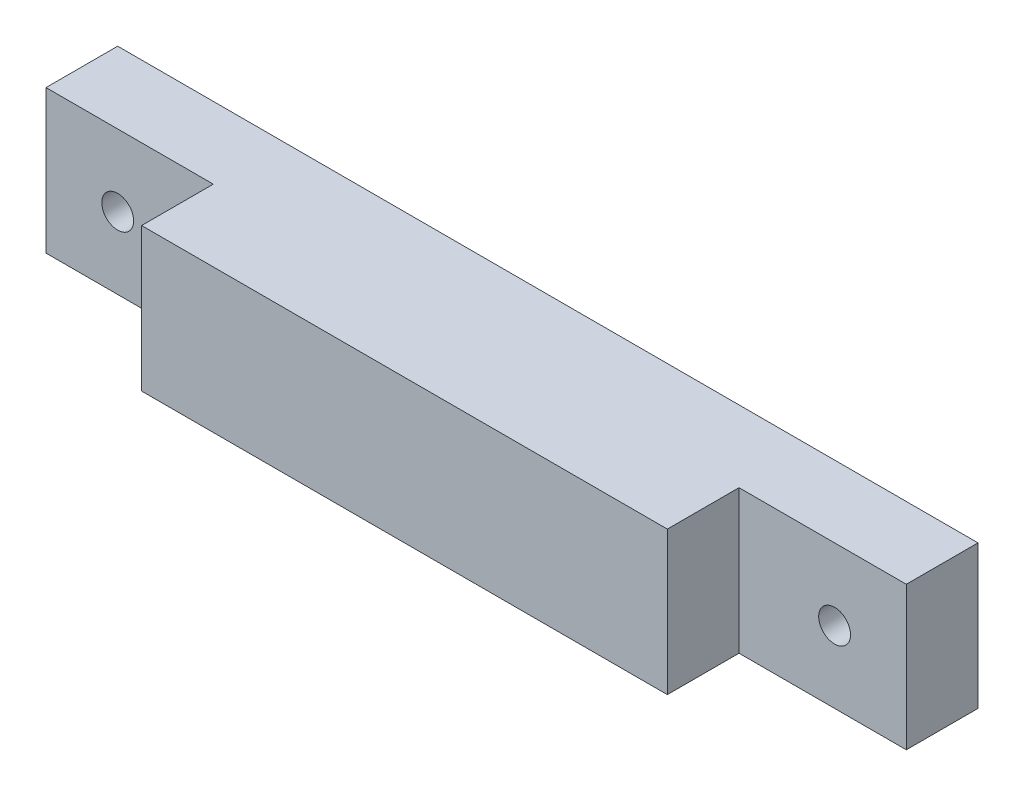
ISO-10303-21;
HEADER;
FILE_DESCRIPTION(('STEP AP214'),'2;1');
FILE_NAME('part.step','',(''),(''),'','','');
FILE_SCHEMA(('AUTOMOTIVE_DESIGN { 1 0 10303 214 1 1 1 1 }'));
ENDSEC;
DATA;
#1=APPLICATION_CONTEXT('core data for automotive mechanical design processes');
#2=APPLICATION_PROTOCOL_DEFINITION('international standard','automotive_design',2000,#1);
#3=PRODUCT_CONTEXT('',#1,'mechanical');
#4=PRODUCT('Part','Part','',(#3));
#5=PRODUCT_RELATED_PRODUCT_CATEGORY('part','',(#4));
#6=PRODUCT_DEFINITION_FORMATION('','',#4);
#7=PRODUCT_DEFINITION_CONTEXT('part definition',#1,'design');
#8=PRODUCT_DEFINITION('design','',#6,#7);
#9=PRODUCT_DEFINITION_SHAPE('','',#8);
#10=(LENGTH_UNIT() NAMED_UNIT(*) SI_UNIT(.MILLI.,.METRE.));
#11=(NAMED_UNIT(*) PLANE_ANGLE_UNIT() SI_UNIT($,.RADIAN.));
#12=(NAMED_UNIT(*) SI_UNIT($,.STERADIAN.) SOLID_ANGLE_UNIT());
#13=UNCERTAINTY_MEASURE_WITH_UNIT(LENGTH_MEASURE(1.E-05),#10,'distance_accuracy_value','');
#14=(GEOMETRIC_REPRESENTATION_CONTEXT(3) GLOBAL_UNCERTAINTY_ASSIGNED_CONTEXT((#13)) GLOBAL_UNIT_ASSIGNED_CONTEXT((#10,
#11,#12)) REPRESENTATION_CONTEXT('',''));
#15=CARTESIAN_POINT('',(0.,0.,0.));
#16=DIRECTION('',(0.,0.,1.));
#17=DIRECTION('',(1.,0.,0.));
#18=AXIS2_PLACEMENT_3D('',#15,#16,#17);
#19=CARTESIAN_POINT('',(54.,0.,9.));
#20=DIRECTION('',(-1.,0.,0.));
#21=DIRECTION('',(0.,0.,1.));
#22=AXIS2_PLACEMENT_3D('',#19,#20,#21);
#23=PLANE('',#22);
#24=DIRECTION('',(0.,1.,0.));
#25=VECTOR('',#24,1.);
#26=CARTESIAN_POINT('',(54.,0.,4.5));
#27=LINE('',#26,#25);
#28=CARTESIAN_POINT('',(54.,0.,4.5));
#29=VERTEX_POINT('',#28);
#30=CARTESIAN_POINT('',(54.,9.,4.5));
#31=VERTEX_POINT('',#30);
#32=EDGE_CURVE('E96',#29,#31,#27,.T.);
#33=ORIENTED_EDGE('',*,*,#32,.F.);
#34=DIRECTION('',(0.,0.,-1.));
#35=VECTOR('',#34,1.);
#36=CARTESIAN_POINT('',(54.,0.,9.));
#37=LINE('',#36,#35);
#38=CARTESIAN_POINT('',(54.,0.,0.));
#39=VERTEX_POINT('',#38);
#40=EDGE_CURVE('E39',#29,#39,#37,.T.);
#41=ORIENTED_EDGE('',*,*,#40,.T.);
#42=DIRECTION('',(0.,1.,0.));
#43=VECTOR('',#42,1.);
#44=CARTESIAN_POINT('',(54.,0.,0.));
#45=LINE('',#44,#43);
#46=CARTESIAN_POINT('',(54.,9.,0.));
#47=VERTEX_POINT('',#46);
#48=EDGE_CURVE('E117',#39,#47,#45,.T.);
#49=ORIENTED_EDGE('',*,*,#48,.T.);
#50=DIRECTION('',(0.,0.,-1.));
#51=VECTOR('',#50,1.);
#52=CARTESIAN_POINT('',(54.,9.,9.));
#53=LINE('',#52,#51);
#54=EDGE_CURVE('E112',#31,#47,#53,.T.);
#55=ORIENTED_EDGE('',*,*,#54,.F.);
#56=EDGE_LOOP('',(#33,#41,#49,#55));
#57=FACE_BOUND('',#56,.T.);
#58=ADVANCED_FACE('F31',(#57),#23,.F.);
#59=CARTESIAN_POINT('',(0.,0.,9.));
#60=DIRECTION('',(1.,0.,0.));
#61=DIRECTION('',(0.,0.,-1.));
#62=AXIS2_PLACEMENT_3D('',#59,#60,#61);
#63=PLANE('',#62);
#64=DIRECTION('',(0.,0.,-1.));
#65=VECTOR('',#64,1.);
#66=CARTESIAN_POINT('',(0.,0.,9.));
#67=LINE('',#66,#65);
#68=CARTESIAN_POINT('',(0.,0.,4.5));
#69=VERTEX_POINT('',#68);
#70=CARTESIAN_POINT('',(0.,0.,0.));
#71=VERTEX_POINT('',#70);
#72=EDGE_CURVE('E11',#69,#71,#67,.T.);
#73=ORIENTED_EDGE('',*,*,#72,.F.);
#74=DIRECTION('',(0.,-1.,0.));
#75=VECTOR('',#74,1.);
#76=CARTESIAN_POINT('',(0.,0.,4.5));
#77=LINE('',#76,#75);
#78=CARTESIAN_POINT('',(0.,9.,4.5));
#79=VERTEX_POINT('',#78);
#80=EDGE_CURVE('E144',#79,#69,#77,.T.);
#81=ORIENTED_EDGE('',*,*,#80,.F.);
#82=DIRECTION('',(0.,0.,-1.));
#83=VECTOR('',#82,1.);
#84=CARTESIAN_POINT('',(0.,9.,9.));
#85=LINE('',#84,#83);
#86=CARTESIAN_POINT('',(0.,9.,0.));
#87=VERTEX_POINT('',#86);
#88=EDGE_CURVE('E119',#79,#87,#85,.T.);
#89=ORIENTED_EDGE('',*,*,#88,.T.);
#90=DIRECTION('',(0.,-1.,0.));
#91=VECTOR('',#90,1.);
#92=CARTESIAN_POINT('',(0.,0.,0.));
#93=LINE('',#92,#91);
#94=EDGE_CURVE('E131',#87,#71,#93,.T.);
#95=ORIENTED_EDGE('',*,*,#94,.T.);
#96=EDGE_LOOP('',(#73,#81,#89,#95));
#97=FACE_BOUND('',#96,.T.);
#98=ADVANCED_FACE('F33',(#97),#63,.F.);
#99=CARTESIAN_POINT('',(0.,0.,9.));
#100=DIRECTION('',(0.,1.,0.));
#101=DIRECTION('',(0.,0.,1.));
#102=AXIS2_PLACEMENT_3D('',#99,#100,#101);
#103=PLANE('',#102);
#104=DIRECTION('',(1.,0.,0.));
#105=VECTOR('',#104,1.);
#106=CARTESIAN_POINT('',(54.,0.,4.5));
#107=LINE('',#106,#105);
#108=CARTESIAN_POINT('',(43.5,0.,4.5));
#109=VERTEX_POINT('',#108);
#110=EDGE_CURVE('E102',#109,#29,#107,.T.);
#111=ORIENTED_EDGE('',*,*,#110,.F.);
#112=DIRECTION('',(0.,0.,1.));
#113=VECTOR('',#112,1.);
#114=CARTESIAN_POINT('',(43.5,0.,4.5));
#115=LINE('',#114,#113);
#116=CARTESIAN_POINT('',(43.5,0.,9.));
#117=VERTEX_POINT('',#116);
#118=EDGE_CURVE('E145',#109,#117,#115,.T.);
#119=ORIENTED_EDGE('',*,*,#118,.T.);
#120=DIRECTION('',(1.,0.,0.));
#121=VECTOR('',#120,1.);
#122=CARTESIAN_POINT('',(0.,0.,9.));
#123=LINE('',#122,#121);
#124=CARTESIAN_POINT('',(10.5,0.,9.));
#125=VERTEX_POINT('',#124);
#126=EDGE_CURVE('E126',#125,#117,#123,.T.);
#127=ORIENTED_EDGE('',*,*,#126,.F.);
#128=DIRECTION('',(0.,0.,1.));
#129=VECTOR('',#128,1.);
#130=CARTESIAN_POINT('',(10.5,0.,4.5));
#131=LINE('',#130,#129);
#132=CARTESIAN_POINT('',(10.5,0.,4.5));
#133=VERTEX_POINT('',#132);
#134=EDGE_CURVE('E54',#133,#125,#131,.T.);
#135=ORIENTED_EDGE('',*,*,#134,.F.);
#136=DIRECTION('',(1.,0.,0.));
#137=VECTOR('',#136,1.);
#138=CARTESIAN_POINT('',(0.,0.,4.5));
#139=LINE('',#138,#137);
#140=EDGE_CURVE('E150',#69,#133,#139,.T.);
#141=ORIENTED_EDGE('',*,*,#140,.F.);
#142=ORIENTED_EDGE('',*,*,#72,.T.);
#143=DIRECTION('',(1.,0.,0.));
#144=VECTOR('',#143,1.);
#145=CARTESIAN_POINT('',(0.,0.,0.));
#146=LINE('',#145,#144);
#147=EDGE_CURVE('E128',#71,#39,#146,.T.);
#148=ORIENTED_EDGE('',*,*,#147,.T.);
#149=ORIENTED_EDGE('',*,*,#40,.F.);
#150=EDGE_LOOP('',(#111,#119,#127,#135,#141,#142,#148,#149));
#151=FACE_BOUND('',#150,.T.);
#152=ADVANCED_FACE('F199',(#151),#103,.F.);
#153=CARTESIAN_POINT('',(0.,9.,9.));
#154=DIRECTION('',(0.,-1.,0.));
#155=DIRECTION('',(0.,0.,-1.));
#156=AXIS2_PLACEMENT_3D('',#153,#154,#155);
#157=PLANE('',#156);
#158=DIRECTION('',(-1.,0.,0.));
#159=VECTOR('',#158,1.);
#160=CARTESIAN_POINT('',(0.,9.,9.));
#161=LINE('',#160,#159);
#162=CARTESIAN_POINT('',(43.5,9.,9.));
#163=VERTEX_POINT('',#162);
#164=CARTESIAN_POINT('',(10.5,9.,9.));
#165=VERTEX_POINT('',#164);
#166=EDGE_CURVE('E121',#163,#165,#161,.T.);
#167=ORIENTED_EDGE('',*,*,#166,.F.);
#168=DIRECTION('',(0.,0.,1.));
#169=VECTOR('',#168,1.);
#170=CARTESIAN_POINT('',(43.5,9.,4.5));
#171=LINE('',#170,#169);
#172=CARTESIAN_POINT('',(43.5,9.,4.5));
#173=VERTEX_POINT('',#172);
#174=EDGE_CURVE('E46',#173,#163,#171,.T.);
#175=ORIENTED_EDGE('',*,*,#174,.F.);
#176=DIRECTION('',(-1.,0.,0.));
#177=VECTOR('',#176,1.);
#178=CARTESIAN_POINT('',(54.,9.,4.5));
#179=LINE('',#178,#177);
#180=EDGE_CURVE('E100',#31,#173,#179,.T.);
#181=ORIENTED_EDGE('',*,*,#180,.F.);
#182=ORIENTED_EDGE('',*,*,#54,.T.);
#183=DIRECTION('',(-1.,0.,0.));
#184=VECTOR('',#183,1.);
#185=CARTESIAN_POINT('',(0.,9.,0.));
#186=LINE('',#185,#184);
#187=EDGE_CURVE('E124',#47,#87,#186,.T.);
#188=ORIENTED_EDGE('',*,*,#187,.T.);
#189=ORIENTED_EDGE('',*,*,#88,.F.);
#190=DIRECTION('',(-1.,0.,0.));
#191=VECTOR('',#190,1.);
#192=CARTESIAN_POINT('',(0.,9.,4.5));
#193=LINE('',#192,#191);
#194=CARTESIAN_POINT('',(10.5,9.,4.5));
#195=VERTEX_POINT('',#194);
#196=EDGE_CURVE('E139',#195,#79,#193,.T.);
#197=ORIENTED_EDGE('',*,*,#196,.F.);
#198=DIRECTION('',(0.,0.,1.));
#199=VECTOR('',#198,1.);
#200=CARTESIAN_POINT('',(10.5,9.,4.5));
#201=LINE('',#200,#199);
#202=EDGE_CURVE('E134',#195,#165,#201,.T.);
#203=ORIENTED_EDGE('',*,*,#202,.T.);
#204=EDGE_LOOP('',(#167,#175,#181,#182,#188,#189,#197,#203));
#205=FACE_BOUND('',#204,.T.);
#206=ADVANCED_FACE('F110',(#205),#157,.F.);
#207=CARTESIAN_POINT('',(0.,9.,9.));
#208=DIRECTION('',(0.,0.,-1.));
#209=DIRECTION('',(-1.,0.,0.));
#210=AXIS2_PLACEMENT_3D('',#207,#208,#209);
#211=PLANE('',#210);
#212=ORIENTED_EDGE('',*,*,#126,.T.);
#213=DIRECTION('',(0.,-1.,0.));
#214=VECTOR('',#213,1.);
#215=CARTESIAN_POINT('',(43.5,0.,9.));
#216=LINE('',#215,#214);
#217=EDGE_CURVE('E106',#163,#117,#216,.T.);
#218=ORIENTED_EDGE('',*,*,#217,.F.);
#219=ORIENTED_EDGE('',*,*,#166,.T.);
#220=DIRECTION('',(0.,1.,0.));
#221=VECTOR('',#220,1.);
#222=CARTESIAN_POINT('',(10.5,0.,9.));
#223=LINE('',#222,#221);
#224=EDGE_CURVE('E142',#125,#165,#223,.T.);
#225=ORIENTED_EDGE('',*,*,#224,.F.);
#226=EDGE_LOOP('',(#212,#218,#219,#225));
#227=FACE_BOUND('',#226,.T.);
#228=ADVANCED_FACE('F208',(#227),#211,.F.);
#229=CARTESIAN_POINT('',(0.,9.,0.));
#230=DIRECTION('',(0.,0.,-1.));
#231=DIRECTION('',(-1.,0.,0.));
#232=AXIS2_PLACEMENT_3D('',#229,#230,#231);
#233=PLANE('',#232);
#234=CARTESIAN_POINT('',(49.5,4.5,0.));
#235=DIRECTION('',(0.,0.,1.));
#236=DIRECTION('',(1.,0.,0.));
#237=AXIS2_PLACEMENT_3D('',#234,#235,#236);
#238=CIRCLE('',#237,0.999999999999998);
#239=CARTESIAN_POINT('',(50.5,4.5,0.));
#240=VERTEX_POINT('',#239);
#241=EDGE_CURVE('E164',#240,#240,#238,.T.);
#242=ORIENTED_EDGE('',*,*,#241,.T.);
#243=EDGE_LOOP('',(#242));
#244=FACE_BOUND('',#243,.T.);
#245=CARTESIAN_POINT('',(4.5,4.5,0.));
#246=DIRECTION('',(0.,0.,1.));
#247=DIRECTION('',(1.,0.,0.));
#248=AXIS2_PLACEMENT_3D('',#245,#246,#247);
#249=CIRCLE('',#248,1.);
#250=CARTESIAN_POINT('',(5.5,4.5,0.));
#251=VERTEX_POINT('',#250);
#252=EDGE_CURVE('E158',#251,#251,#249,.T.);
#253=ORIENTED_EDGE('',*,*,#252,.T.);
#254=EDGE_LOOP('',(#253));
#255=FACE_BOUND('',#254,.T.);
#256=ORIENTED_EDGE('',*,*,#94,.F.);
#257=ORIENTED_EDGE('',*,*,#187,.F.);
#258=ORIENTED_EDGE('',*,*,#48,.F.);
#259=ORIENTED_EDGE('',*,*,#147,.F.);
#260=EDGE_LOOP('',(#256,#257,#258,#259));
#261=FACE_BOUND('',#260,.T.);
#262=ADVANCED_FACE('F173',(#244,#255,#261),#233,.T.);
#263=CARTESIAN_POINT('',(10.5,0.,4.5));
#264=DIRECTION('',(1.,0.,0.));
#265=DIRECTION('',(0.,0.,-1.));
#266=AXIS2_PLACEMENT_3D('',#263,#264,#265);
#267=PLANE('',#266);
#268=ORIENTED_EDGE('',*,*,#224,.T.);
#269=ORIENTED_EDGE('',*,*,#202,.F.);
#270=DIRECTION('',(0.,1.,0.));
#271=VECTOR('',#270,1.);
#272=CARTESIAN_POINT('',(10.5,0.,4.5));
#273=LINE('',#272,#271);
#274=EDGE_CURVE('E147',#133,#195,#273,.T.);
#275=ORIENTED_EDGE('',*,*,#274,.F.);
#276=ORIENTED_EDGE('',*,*,#134,.T.);
#277=EDGE_LOOP('',(#268,#269,#275,#276));
#278=FACE_BOUND('',#277,.T.);
#279=ADVANCED_FACE('F220',(#278),#267,.F.);
#280=CARTESIAN_POINT('',(0.,9.,4.5));
#281=DIRECTION('',(0.,0.,-1.));
#282=DIRECTION('',(-1.,0.,0.));
#283=AXIS2_PLACEMENT_3D('',#280,#281,#282);
#284=PLANE('',#283);
#285=CARTESIAN_POINT('',(4.5,4.5,4.5));
#286=DIRECTION('',(0.,0.,1.));
#287=DIRECTION('',(1.,0.,0.));
#288=AXIS2_PLACEMENT_3D('',#285,#286,#287);
#289=CIRCLE('',#288,1.);
#290=CARTESIAN_POINT('',(5.5,4.5,4.5));
#291=VERTEX_POINT('',#290);
#292=EDGE_CURVE('E161',#291,#291,#289,.T.);
#293=ORIENTED_EDGE('',*,*,#292,.F.);
#294=EDGE_LOOP('',(#293));
#295=FACE_BOUND('',#294,.T.);
#296=ORIENTED_EDGE('',*,*,#80,.T.);
#297=ORIENTED_EDGE('',*,*,#140,.T.);
#298=ORIENTED_EDGE('',*,*,#274,.T.);
#299=ORIENTED_EDGE('',*,*,#196,.T.);
#300=EDGE_LOOP('',(#296,#297,#298,#299));
#301=FACE_BOUND('',#300,.T.);
#302=ADVANCED_FACE('F192',(#295,#301),#284,.F.);
#303=CARTESIAN_POINT('',(43.5,0.,4.5));
#304=DIRECTION('',(-1.,0.,0.));
#305=DIRECTION('',(0.,0.,1.));
#306=AXIS2_PLACEMENT_3D('',#303,#304,#305);
#307=PLANE('',#306);
#308=ORIENTED_EDGE('',*,*,#217,.T.);
#309=ORIENTED_EDGE('',*,*,#118,.F.);
#310=DIRECTION('',(0.,-1.,0.));
#311=VECTOR('',#310,1.);
#312=CARTESIAN_POINT('',(43.5,0.,4.5));
#313=LINE('',#312,#311);
#314=EDGE_CURVE('E114',#173,#109,#313,.T.);
#315=ORIENTED_EDGE('',*,*,#314,.F.);
#316=ORIENTED_EDGE('',*,*,#174,.T.);
#317=EDGE_LOOP('',(#308,#309,#315,#316));
#318=FACE_BOUND('',#317,.T.);
#319=ADVANCED_FACE('F184',(#318),#307,.F.);
#320=CARTESIAN_POINT('',(54.,9.,4.5));
#321=DIRECTION('',(0.,0.,1.));
#322=DIRECTION('',(1.,0.,0.));
#323=AXIS2_PLACEMENT_3D('',#320,#321,#322);
#324=PLANE('',#323);
#325=CARTESIAN_POINT('',(49.5,4.5,4.5));
#326=DIRECTION('',(0.,0.,1.));
#327=DIRECTION('',(1.,0.,0.));
#328=AXIS2_PLACEMENT_3D('',#325,#326,#327);
#329=CIRCLE('',#328,0.999999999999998);
#330=CARTESIAN_POINT('',(50.5,4.5,4.5));
#331=VERTEX_POINT('',#330);
#332=EDGE_CURVE('E167',#331,#331,#329,.T.);
#333=ORIENTED_EDGE('',*,*,#332,.F.);
#334=EDGE_LOOP('',(#333));
#335=FACE_BOUND('',#334,.T.);
#336=ORIENTED_EDGE('',*,*,#32,.T.);
#337=ORIENTED_EDGE('',*,*,#180,.T.);
#338=ORIENTED_EDGE('',*,*,#314,.T.);
#339=ORIENTED_EDGE('',*,*,#110,.T.);
#340=EDGE_LOOP('',(#336,#337,#338,#339));
#341=FACE_BOUND('',#340,.T.);
#342=ADVANCED_FACE('F98',(#335,#341),#324,.T.);
#343=CARTESIAN_POINT('',(4.5,4.5,0.));
#344=DIRECTION('',(0.,0.,1.));
#345=DIRECTION('',(1.,0.,0.));
#346=AXIS2_PLACEMENT_3D('',#343,#344,#345);
#347=CYLINDRICAL_SURFACE('',#346,1.);
#348=ORIENTED_EDGE('',*,*,#252,.F.);
#349=EDGE_LOOP('',(#348));
#350=FACE_BOUND('',#349,.T.);
#351=ORIENTED_EDGE('',*,*,#292,.T.);
#352=EDGE_LOOP('',(#351));
#353=FACE_BOUND('',#352,.T.);
#354=ADVANCED_FACE('F179',(#350,#353),#347,.F.);
#355=CARTESIAN_POINT('',(49.5,4.5,0.));
#356=DIRECTION('',(0.,0.,1.));
#357=DIRECTION('',(1.,0.,0.));
#358=AXIS2_PLACEMENT_3D('',#355,#356,#357);
#359=CYLINDRICAL_SURFACE('',#358,0.999999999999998);
#360=ORIENTED_EDGE('',*,*,#241,.F.);
#361=EDGE_LOOP('',(#360));
#362=FACE_BOUND('',#361,.T.);
#363=ORIENTED_EDGE('',*,*,#332,.T.);
#364=EDGE_LOOP('',(#363));
#365=FACE_BOUND('',#364,.T.);
#366=ADVANCED_FACE('F176',(#362,#365),#359,.F.);
#367=CLOSED_SHELL('',(#58,#98,#152,#206,#228,#262,#279,#302,#319,#342,#354,#366));
#368=MANIFOLD_SOLID_BREP('B2',#367);
#369=ADVANCED_BREP_SHAPE_REPRESENTATION('',(#18,#368),#14);
#370=SHAPE_DEFINITION_REPRESENTATION(#9,#369);
ENDSEC;
END-ISO-10303-21;
